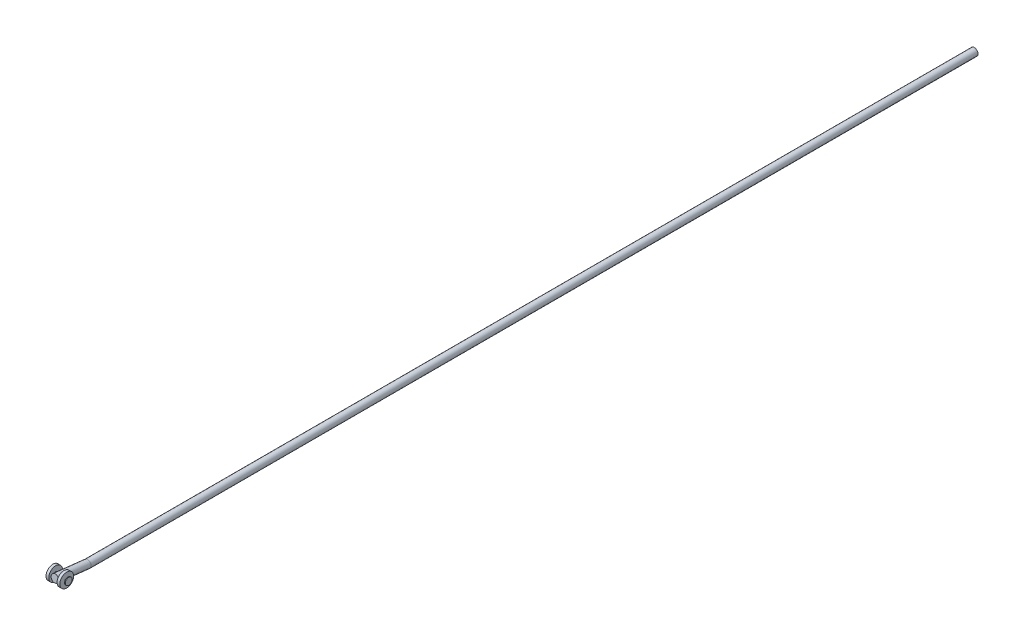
ISO-10303-21;
HEADER;
FILE_DESCRIPTION(('STEP AP214'),'2;1');
FILE_NAME('part.step','',(''),(''),'','','');
FILE_SCHEMA(('AUTOMOTIVE_DESIGN { 1 0 10303 214 1 1 1 1 }'));
ENDSEC;
DATA;
#1=APPLICATION_CONTEXT('core data for automotive mechanical design processes');
#2=APPLICATION_PROTOCOL_DEFINITION('international standard','automotive_design',2000,#1);
#3=PRODUCT_CONTEXT('',#1,'mechanical');
#4=PRODUCT('Part','Part','',(#3));
#5=PRODUCT_RELATED_PRODUCT_CATEGORY('part','',(#4));
#6=PRODUCT_DEFINITION_FORMATION('','',#4);
#7=PRODUCT_DEFINITION_CONTEXT('part definition',#1,'design');
#8=PRODUCT_DEFINITION('design','',#6,#7);
#9=PRODUCT_DEFINITION_SHAPE('','',#8);
#10=(LENGTH_UNIT() NAMED_UNIT(*) SI_UNIT(.MILLI.,.METRE.));
#11=(NAMED_UNIT(*) PLANE_ANGLE_UNIT() SI_UNIT($,.RADIAN.));
#12=(NAMED_UNIT(*) SI_UNIT($,.STERADIAN.) SOLID_ANGLE_UNIT());
#13=UNCERTAINTY_MEASURE_WITH_UNIT(LENGTH_MEASURE(1.E-05),#10,'distance_accuracy_value','');
#14=(GEOMETRIC_REPRESENTATION_CONTEXT(3) GLOBAL_UNCERTAINTY_ASSIGNED_CONTEXT((#13)) GLOBAL_UNIT_ASSIGNED_CONTEXT((#10,
#11,#12)) REPRESENTATION_CONTEXT('',''));
#15=CARTESIAN_POINT('',(0.,0.,0.));
#16=DIRECTION('',(0.,0.,1.));
#17=DIRECTION('',(1.,0.,0.));
#18=AXIS2_PLACEMENT_3D('',#15,#16,#17);
#19=CARTESIAN_POINT('',(9.75,3.4180682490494,992.5));
#20=DIRECTION('',(-1.,0.,0.));
#21=DIRECTION('',(0.,0.,1.));
#22=AXIS2_PLACEMENT_3D('',#19,#20,#21);
#23=CYLINDRICAL_SURFACE('',#22,2.);
#24=CARTESIAN_POINT('',(7.5,3.4180682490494,992.5));
#25=DIRECTION('',(-1.,0.,0.));
#26=DIRECTION('',(0.,0.,1.));
#27=AXIS2_PLACEMENT_3D('',#24,#25,#26);
#28=CIRCLE('',#27,2.);
#29=CARTESIAN_POINT('',(7.5,3.41806824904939,994.5));
#30=VERTEX_POINT('',#29);
#31=EDGE_CURVE('E20',#30,#30,#28,.T.);
#32=ORIENTED_EDGE('',*,*,#31,.F.);
#33=EDGE_LOOP('',(#32));
#34=FACE_BOUND('',#33,.T.);
#35=CARTESIAN_POINT('',(8.95,3.4180682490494,992.5));
#36=DIRECTION('',(1.,0.,0.));
#37=DIRECTION('',(0.,0.,-1.));
#38=AXIS2_PLACEMENT_3D('',#35,#36,#37);
#39=CIRCLE('',#38,2.);
#40=CARTESIAN_POINT('',(8.95,3.4180682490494,990.5));
#41=VERTEX_POINT('',#40);
#42=EDGE_CURVE('E8',#41,#41,#39,.T.);
#43=ORIENTED_EDGE('',*,*,#42,.F.);
#44=EDGE_LOOP('',(#43));
#45=FACE_BOUND('',#44,.T.);
#46=ADVANCED_FACE('F12',(#34,#45),#23,.T.);
#47=CARTESIAN_POINT('',(0.,0.,962.5));
#48=DIRECTION('',(0.,0.113203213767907,0.993571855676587));
#49=DIRECTION('',(0.,-0.993571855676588,0.113203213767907));
#50=AXIS2_PLACEMENT_3D('',#47,#48,#49);
#51=CYLINDRICAL_SURFACE('',#50,4.);
#52=CARTESIAN_POINT('',(-3.99358737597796,3.4180682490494,994.5));
#53=CARTESIAN_POINT('',(-3.99937040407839,3.52083185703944,994.499993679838));
#54=CARTESIAN_POINT('',(-4.00126596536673,3.62391842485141,994.492037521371));
#55=CARTESIAN_POINT('',(-3.99705373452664,3.82755391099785,994.460349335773));
#56=CARTESIAN_POINT('',(-3.99093520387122,3.92809924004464,994.436596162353));
#57=CARTESIAN_POINT('',(-3.97132265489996,4.12343046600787,994.374285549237));
#58=CARTESIAN_POINT('',(-3.95784720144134,4.21823019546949,994.335765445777));
#59=CARTESIAN_POINT('',(-3.92479936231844,4.39999315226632,994.245319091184));
#60=CARTESIAN_POINT('',(-3.90522686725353,4.48695623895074,994.1933925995));
#61=CARTESIAN_POINT('',(-3.860794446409,4.65468987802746,994.075344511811));
#62=CARTESIAN_POINT('',(-3.83575190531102,4.73506492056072,994.008731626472));
#63=CARTESIAN_POINT('',(-3.78309154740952,4.88412669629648,993.864351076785));
#64=CARTESIAN_POINT('',(-3.75547224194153,4.95280660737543,993.786576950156));
#65=CARTESIAN_POINT('',(-3.69731707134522,5.08348571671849,993.613236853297));
#66=CARTESIAN_POINT('',(-3.66676215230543,5.14415845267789,993.5166727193));
#67=CARTESIAN_POINT('',(-3.60884209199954,5.24855643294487,993.313832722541));
#68=CARTESIAN_POINT('',(-3.58147772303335,5.29227757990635,993.207554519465));
#69=CARTESIAN_POINT('',(-3.53343540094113,5.3612486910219,992.987240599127));
#70=CARTESIAN_POINT('',(-3.51277948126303,5.38643812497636,992.873180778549));
#71=CARTESIAN_POINT('',(-3.48162431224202,5.41649811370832,992.641114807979));
#72=CARTESIAN_POINT('',(-3.47110985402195,5.42139913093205,992.523114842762));
#73=CARTESIAN_POINT('',(-3.46268321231,5.41094218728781,992.302097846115));
#74=CARTESIAN_POINT('',(-3.46338626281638,5.39799006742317,992.199014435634));
#75=CARTESIAN_POINT('',(-3.47394233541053,5.35642104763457,991.996545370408));
#76=CARTESIAN_POINT('',(-3.48379609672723,5.32780288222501,991.897160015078));
#77=CARTESIAN_POINT('',(-3.51058114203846,5.25784202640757,991.709567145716));
#78=CARTESIAN_POINT('',(-3.52715111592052,5.21717390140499,991.621052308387));
#79=CARTESIAN_POINT('',(-3.56542142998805,5.12405317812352,991.451685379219));
#80=CARTESIAN_POINT('',(-3.58712341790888,5.07159679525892,991.370835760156));
#81=CARTESIAN_POINT('',(-3.63604919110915,4.95001498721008,991.209897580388));
#82=CARTESIAN_POINT('',(-3.66361477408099,4.87971004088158,991.130804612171));
#83=CARTESIAN_POINT('',(-3.71971318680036,4.72772581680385,990.984771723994));
#84=CARTESIAN_POINT('',(-3.74824663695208,4.64603913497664,990.91783978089));
#85=CARTESIAN_POINT('',(-3.80636968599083,4.46428600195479,990.7915417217));
#86=CARTESIAN_POINT('',(-3.83579137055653,4.36320425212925,990.733547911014));
#87=CARTESIAN_POINT('',(-3.88944229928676,4.15134454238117,990.635621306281));
#88=CARTESIAN_POINT('',(-3.91367316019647,4.04056961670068,990.595682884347));
#89=CARTESIAN_POINT('',(-3.9533537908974,3.81687969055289,990.536896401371));
#90=CARTESIAN_POINT('',(-3.96911584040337,3.70422722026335,990.517269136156));
#91=CARTESIAN_POINT('',(-3.99144832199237,3.47635133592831,990.497588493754));
#92=CARTESIAN_POINT('',(-3.99802618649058,3.36113007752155,990.497519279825));
#93=CARTESIAN_POINT('',(-4.00105151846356,3.143597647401,990.516217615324));
#94=CARTESIAN_POINT('',(-3.99843484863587,3.04113478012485,990.533126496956));
#95=CARTESIAN_POINT('',(-3.98538179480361,2.84053554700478,990.582418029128));
#96=CARTESIAN_POINT('',(-3.97494569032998,2.74239902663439,990.614800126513));
#97=CARTESIAN_POINT('',(-3.94751258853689,2.55473751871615,990.69311619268));
#98=CARTESIAN_POINT('',(-3.93063121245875,2.46509368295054,990.738808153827));
#99=CARTESIAN_POINT('',(-3.89178602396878,2.29444036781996,990.842460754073));
#100=CARTESIAN_POINT('',(-3.86982092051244,2.21343308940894,990.900424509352));
#101=CARTESIAN_POINT('',(-3.82068014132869,2.05528166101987,991.032262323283));
#102=CARTESIAN_POINT('',(-3.79322649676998,1.978982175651,991.10704491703));
#103=CARTESIAN_POINT('',(-3.73695766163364,1.83937451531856,991.267501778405));
#104=CARTESIAN_POINT('',(-3.70814145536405,1.77607622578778,991.353184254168));
#105=CARTESIAN_POINT('',(-3.64943029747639,1.65883711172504,991.541640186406));
#106=CARTESIAN_POINT('',(-3.6196559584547,1.60617054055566,991.645249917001));
#107=CARTESIAN_POINT('',(-3.56540497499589,1.51924585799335,991.861245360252));
#108=CARTESIAN_POINT('',(-3.54092619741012,1.48498032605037,991.973627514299));
#109=CARTESIAN_POINT('',(-3.50169898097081,1.4374997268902,992.199743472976));
#110=CARTESIAN_POINT('',(-3.48660715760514,1.42351314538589,992.313252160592));
#111=CARTESIAN_POINT('',(-3.46722537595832,1.41524850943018,992.541853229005));
#112=CARTESIAN_POINT('',(-3.4629222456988,1.42094640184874,992.656943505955));
#113=CARTESIAN_POINT('',(-3.46566946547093,1.45002321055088,992.869982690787));
#114=CARTESIAN_POINT('',(-3.47136600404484,1.4710995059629,992.968273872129));
#115=CARTESIAN_POINT('',(-3.49076284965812,1.52742346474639,993.159876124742));
#116=CARTESIAN_POINT('',(-3.50446544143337,1.56267517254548,993.253185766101));
#117=CARTESIAN_POINT('',(-3.53814243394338,1.6460190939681,993.432537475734));
#118=CARTESIAN_POINT('',(-3.55811370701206,1.69410490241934,993.518583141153));
#119=CARTESIAN_POINT('',(-3.60218691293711,1.80174486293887,993.681981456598));
#120=CARTESIAN_POINT('',(-3.62629024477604,1.86130289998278,993.759331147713));
#121=CARTESIAN_POINT('',(-3.67953416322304,1.99864251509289,993.913201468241));
#122=CARTESIAN_POINT('',(-3.70892913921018,2.07776661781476,993.988438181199));
#123=CARTESIAN_POINT('',(-3.76720952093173,2.24736352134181,994.125216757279));
#124=CARTESIAN_POINT('',(-3.79609442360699,2.33784688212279,994.186745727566));
#125=CARTESIAN_POINT('',(-3.85236688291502,2.53473146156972,994.298149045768));
#126=CARTESIAN_POINT('',(-3.87952938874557,2.64178941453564,994.346984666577));
#127=CARTESIAN_POINT('',(-3.92698634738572,2.86402905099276,994.425316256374));
#128=CARTESIAN_POINT('',(-3.94729855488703,2.97918878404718,994.454862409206));
#129=CARTESIAN_POINT('',(-3.97005554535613,3.14945629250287,994.482608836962));
#130=CARTESIAN_POINT('',(-3.97618789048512,3.20283030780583,994.489112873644));
#131=CARTESIAN_POINT('',(-3.98643408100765,3.31012918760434,994.497810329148));
#132=CARTESIAN_POINT('',(-3.99054772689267,3.36405410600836,994.500003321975));
#133=CARTESIAN_POINT('',(-3.99358737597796,3.4180682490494,994.5));
#134=B_SPLINE_CURVE_WITH_KNOTS('',3,(#52,#53,#54,#55,#56,#57,#58,#59,#60,#61,#62,#63,#64,#65,
#66,#67,#68,#69,#70,#71,#72,#73,#74,#75,#76,#77,#78,#79,#80,#81,#82,#83,#84,#85,#86,#87,#88,#89,
#90,#91,#92,#93,#94,#95,#96,#97,#98,#99,#100,#101,#102,#103,#104,#105,#106,#107,#108,#109,#110,
#111,#112,#113,#114,#115,#116,#117,#118,#119,#120,#121,#122,#123,#124,#125,#126,#127,#128,#129,
#130,#131,#132,#133),.UNSPECIFIED.,.T.,.F.,(4,2,2,2,2,2,2,2,2,2,2,2,2,2,2,2,2,2,2,2,2,2,2,2,2,2,
2,2,2,2,2,2,2,2,2,2,2,2,2,2,4),(0.,0.308569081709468,0.617552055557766,0.9257589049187,
1.23397128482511,1.55471444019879,1.87564405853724,2.22821798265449,2.58087707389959,
2.93468300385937,3.28795751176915,3.59799922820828,3.90806599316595,4.20329261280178,
4.49861414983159,4.82534672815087,5.1522928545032,5.51109030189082,5.86977583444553,
6.21412414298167,6.55819362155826,6.86830063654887,7.17839656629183,7.48317289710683,
7.78802671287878,8.11757839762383,8.44737973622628,8.80556609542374,9.16360790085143,
9.50763416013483,9.85124019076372,10.1518331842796,10.4525120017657,10.7530410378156,
11.0536720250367,11.3914576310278,11.7295596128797,12.0900019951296,12.4495028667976,
12.6116755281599,12.7738642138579),.UNSPECIFIED.);
#135=CARTESIAN_POINT('',(-3.99358737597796,3.4180682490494,994.5));
#136=VERTEX_POINT('',#135);
#137=EDGE_CURVE('E47',#136,#136,#134,.T.);
#138=ORIENTED_EDGE('',*,*,#137,.F.);
#139=EDGE_LOOP('',(#138));
#140=FACE_BOUND('',#139,.T.);
#141=CARTESIAN_POINT('',(0.,0.,962.5));
#142=DIRECTION('',(0.,0.0566927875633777,0.998391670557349));
#143=DIRECTION('',(0.,0.998391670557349,-0.0566927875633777));
#144=AXIS2_PLACEMENT_3D('',#141,#142,#143);
#145=ELLIPSE('',#144,4.00644368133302,4.);
#146=CARTESIAN_POINT('',(0.,4.,962.27286353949));
#147=VERTEX_POINT('',#146);
#148=EDGE_CURVE('E115',#147,#147,#145,.F.);
#149=ORIENTED_EDGE('',*,*,#148,.F.);
#150=EDGE_LOOP('',(#149));
#151=FACE_BOUND('',#150,.T.);
#152=CARTESIAN_POINT('',(0.,4.03218117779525,997.89));
#153=DIRECTION('',(0.,0.113203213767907,0.993571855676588));
#154=DIRECTION('',(0.,-0.993571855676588,0.113203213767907));
#155=AXIS2_PLACEMENT_3D('',#152,#153,#154);
#156=CIRCLE('',#155,4.);
#157=CARTESIAN_POINT('',(0.,0.0578937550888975,998.342812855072));
#158=VERTEX_POINT('',#157);
#159=EDGE_CURVE('E113',#158,#158,#156,.T.);
#160=ORIENTED_EDGE('',*,*,#159,.F.);
#161=EDGE_LOOP('',(#160));
#162=FACE_BOUND('',#161,.T.);
#163=CARTESIAN_POINT('',(3.99358737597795,3.4180682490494,994.5));
#164=CARTESIAN_POINT('',(3.9874930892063,3.30997215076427,994.49999370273));
#165=CARTESIAN_POINT('',(3.97707821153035,3.20197487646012,994.491184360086));
#166=CARTESIAN_POINT('',(3.94869154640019,2.98963618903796,994.456547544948));
#167=CARTESIAN_POINT('',(3.93070160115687,2.88530421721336,994.430679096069));
#168=CARTESIAN_POINT('',(3.88906878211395,2.68362880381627,994.363289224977));
#169=CARTESIAN_POINT('',(3.86545309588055,2.58625459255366,994.321842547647));
#170=CARTESIAN_POINT('',(3.81469645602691,2.39998180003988,994.224686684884));
#171=CARTESIAN_POINT('',(3.78755593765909,2.31108217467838,994.168979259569));
#172=CARTESIAN_POINT('',(3.73015274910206,2.13728452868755,994.040165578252));
#173=CARTESIAN_POINT('',(3.69980537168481,2.05312215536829,993.966102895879));
#174=CARTESIAN_POINT('',(3.64094720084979,1.89796551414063,993.80454563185));
#175=CARTESIAN_POINT('',(3.6124374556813,1.82697871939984,993.717043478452));
#176=CARTESIAN_POINT('',(3.55981419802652,1.69809426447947,993.527253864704));
#177=CARTESIAN_POINT('',(3.53586896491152,1.64068362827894,993.424585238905));
#178=CARTESIAN_POINT('',(3.49722192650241,1.54438653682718,993.209340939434));
#179=CARTESIAN_POINT('',(3.48250686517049,1.50547353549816,993.096779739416));
#180=CARTESIAN_POINT('',(3.46590658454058,1.45132692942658,992.878372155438));
#181=CARTESIAN_POINT('',(3.46278904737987,1.43396087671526,992.773147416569));
#182=CARTESIAN_POINT('',(3.466432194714,1.41619514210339,992.561456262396));
#183=CARTESIAN_POINT('',(3.47319098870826,1.41579221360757,992.454990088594));
#184=CARTESIAN_POINT('',(3.49465644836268,1.43104833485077,992.25246760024));
#185=CARTESIAN_POINT('',(3.50870991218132,1.4454709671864,992.156241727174));
#186=CARTESIAN_POINT('',(3.54264133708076,1.48774071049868,991.967871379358));
#187=CARTESIAN_POINT('',(3.56252112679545,1.51559203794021,991.875728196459));
#188=CARTESIAN_POINT('',(3.60796995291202,1.58671705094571,991.689489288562));
#189=CARTESIAN_POINT('',(3.63388111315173,1.63111050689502,991.595906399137));
#190=CARTESIAN_POINT('',(3.6875889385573,1.73347599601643,991.417050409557));
#191=CARTESIAN_POINT('',(3.71538677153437,1.79145649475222,991.331782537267));
#192=CARTESIAN_POINT('',(3.77350073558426,1.92726056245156,991.161859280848));
#193=CARTESIAN_POINT('',(3.80374405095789,2.00659035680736,991.07837471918));
#194=CARTESIAN_POINT('',(3.86025903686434,2.17922180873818,990.92566451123));
#195=CARTESIAN_POINT('',(3.88653082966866,2.27252303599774,990.856438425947));
#196=CARTESIAN_POINT('',(3.93189876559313,2.46960031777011,990.735466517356));
#197=CARTESIAN_POINT('',(3.95109048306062,2.57321089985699,990.683488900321));
#198=CARTESIAN_POINT('',(3.98055431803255,2.78894553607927,990.597992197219));
#199=CARTESIAN_POINT('',(3.99083441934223,2.90106187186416,990.564456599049));
#200=CARTESIAN_POINT('',(4.00069753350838,3.11837964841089,990.519787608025));
#201=CARTESIAN_POINT('',(4.00124897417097,3.22314868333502,990.506746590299));
#202=CARTESIAN_POINT('',(3.99406901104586,3.43313775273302,990.497298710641));
#203=CARTESIAN_POINT('',(3.98633880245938,3.53835771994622,990.500889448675));
#204=CARTESIAN_POINT('',(3.9638353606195,3.74210885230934,990.523863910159));
#205=CARTESIAN_POINT('',(3.94934283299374,3.84074192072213,990.542638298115));
#206=CARTESIAN_POINT('',(3.91473719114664,4.03317390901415,990.594329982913));
#207=CARTESIAN_POINT('',(3.89462293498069,4.12697184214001,990.627250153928));
#208=CARTESIAN_POINT('',(3.84894231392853,4.31399603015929,990.708795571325));
#209=CARTESIAN_POINT('',(3.82309969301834,4.40675688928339,990.758330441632));
#210=CARTESIAN_POINT('',(3.76918536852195,4.5829941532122,990.870921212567));
#211=CARTESIAN_POINT('',(3.74111218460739,4.66646430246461,990.933986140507));
#212=CARTESIAN_POINT('',(3.68256139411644,4.83009751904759,991.079002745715));
#213=CARTESIAN_POINT('',(3.65210950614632,4.90918801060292,991.162181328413));
#214=CARTESIAN_POINT('',(3.59502919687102,5.05253348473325,991.341677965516));
#215=CARTESIAN_POINT('',(3.56840096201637,5.11678774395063,991.43799666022));
#216=CARTESIAN_POINT('',(3.52281400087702,5.22774267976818,991.640760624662));
#217=CARTESIAN_POINT('',(3.50378417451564,5.27460578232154,991.747099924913));
#218=CARTESIAN_POINT('',(3.47616820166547,5.34936257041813,991.967470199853));
#219=CARTESIAN_POINT('',(3.4675669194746,5.3772837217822,992.081489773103));
#220=CARTESIAN_POINT('',(3.4626778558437,5.41051584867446,992.298374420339));
#221=CARTESIAN_POINT('',(3.46498303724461,5.4182202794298,992.400848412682));
#222=CARTESIAN_POINT('',(3.47839582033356,5.41791165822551,992.605191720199));
#223=CARTESIAN_POINT('',(3.48950487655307,5.40989600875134,992.707060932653));
#224=CARTESIAN_POINT('',(3.51849768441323,5.37930225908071,992.903932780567));
#225=CARTESIAN_POINT('',(3.53614055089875,5.35722393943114,992.999051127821));
#226=CARTESIAN_POINT('',(3.57625173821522,5.29991232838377,993.184148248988));
#227=CARTESIAN_POINT('',(3.59872170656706,5.26467454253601,993.274125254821));
#228=CARTESIAN_POINT('',(3.64907495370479,5.17731075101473,993.457340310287));
#229=CARTESIAN_POINT('',(3.67728312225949,5.12372348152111,993.549792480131));
#230=CARTESIAN_POINT('',(3.73422806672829,5.00263259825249,993.724950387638));
#231=CARTESIAN_POINT('',(3.76296514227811,4.93512086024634,993.807650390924));
#232=CARTESIAN_POINT('',(3.82075045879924,4.78081390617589,993.968470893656));
#233=CARTESIAN_POINT('',(3.8496020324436,4.69284221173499,994.045541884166));
#234=CARTESIAN_POINT('',(3.90160341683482,4.50364034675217,994.183818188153));
#235=CARTESIAN_POINT('',(3.92475344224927,4.40241067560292,994.245024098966));
#236=CARTESIAN_POINT('',(3.96169304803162,4.1947429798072,994.346473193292));
#237=CARTESIAN_POINT('',(3.97589092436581,4.08881442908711,994.387607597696));
#238=CARTESIAN_POINT('',(3.99500612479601,3.87088974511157,994.451350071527));
#239=CARTESIAN_POINT('',(3.99994832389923,3.75891070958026,994.474007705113));
#240=CARTESIAN_POINT('',(4.00001693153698,3.60814677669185,994.491314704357));
#241=CARTESIAN_POINT('',(3.99948422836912,3.57018324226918,994.494570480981));
#242=CARTESIAN_POINT('',(3.99734178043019,3.49416513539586,994.498914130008));
#243=CARTESIAN_POINT('',(3.99573214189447,3.45611057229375,994.500002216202));
#244=CARTESIAN_POINT('',(3.99358737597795,3.4180682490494,994.5));
#245=B_SPLINE_CURVE_WITH_KNOTS('',3,(#163,#164,#165,#166,#167,#168,#169,#170,#171,#172,#173,
#174,#175,#176,#177,#178,#179,#180,#181,#182,#183,#184,#185,#186,#187,#188,#189,#190,#191,#192,
#193,#194,#195,#196,#197,#198,#199,#200,#201,#202,#203,#204,#205,#206,#207,#208,#209,#210,#211,
#212,#213,#214,#215,#216,#217,#218,#219,#220,#221,#222,#223,#224,#225,#226,#227,#228,#229,#230,
#231,#232,#233,#234,#235,#236,#237,#238,#239,#240,#241,#242,#243,#244),.UNSPECIFIED.,.T.,.F.,(4,
2,2,2,2,2,2,2,2,2,2,2,2,2,2,2,2,2,2,2,2,2,2,2,2,2,2,2,2,2,2,2,2,2,2,2,2,2,2,2,4),(0.,
0.324645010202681,0.650072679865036,0.97395846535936,1.29780429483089,1.64470914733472,
1.99181016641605,2.34992937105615,2.70753307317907,3.02583438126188,3.34407476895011,
3.63777018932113,3.93155788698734,4.2505957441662,4.56983291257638,4.92534924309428,
5.28085462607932,5.63136832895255,5.9815676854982,6.29668549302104,6.61175782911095,
6.91477864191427,7.21786105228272,7.54138871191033,7.86513290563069,8.21971858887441,
8.57432155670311,8.92552395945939,9.27621602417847,9.58299411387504,9.88982289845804,
10.1863131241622,10.4829047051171,10.8131058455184,11.1435001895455,11.5030741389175,
11.8626345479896,12.2043113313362,12.5450685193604,12.6593322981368,12.7735848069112),.UNSPECIFIED.);
#246=CARTESIAN_POINT('',(3.99358737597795,3.4180682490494,994.5));
#247=VERTEX_POINT('',#246);
#248=EDGE_CURVE('E28',#247,#247,#245,.T.);
#249=ORIENTED_EDGE('',*,*,#248,.F.);
#250=EDGE_LOOP('',(#249));
#251=FACE_BOUND('',#250,.T.);
#252=ADVANCED_FACE('F14',(#140,#151,#162,#251),#51,.T.);
#253=CARTESIAN_POINT('',(0.,0.,0.));
#254=DIRECTION('',(0.,0.,-1.));
#255=DIRECTION('',(-1.,0.,0.));
#256=AXIS2_PLACEMENT_3D('',#253,#254,#255);
#257=PLANE('',#256);
#258=CARTESIAN_POINT('',(0.,0.,0.));
#259=DIRECTION('',(0.,0.,-1.));
#260=DIRECTION('',(-1.,0.,0.));
#261=AXIS2_PLACEMENT_3D('',#258,#259,#260);
#262=CIRCLE('',#261,4.);
#263=CARTESIAN_POINT('',(-4.,0.,0.));
#264=VERTEX_POINT('',#263);
#265=EDGE_CURVE('E118',#264,#264,#262,.T.);
#266=ORIENTED_EDGE('',*,*,#265,.T.);
#267=EDGE_LOOP('',(#266));
#268=FACE_BOUND('',#267,.T.);
#269=ADVANCED_FACE('F68',(#268),#257,.T.);
#270=CARTESIAN_POINT('',(0.,0.,973.813708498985));
#271=DIRECTION('',(0.,0.,-1.));
#272=DIRECTION('',(0.,1.,0.));
#273=AXIS2_PLACEMENT_3D('',#270,#271,#272);
#274=CYLINDRICAL_SURFACE('',#273,4.);
#275=ORIENTED_EDGE('',*,*,#265,.F.);
#276=EDGE_LOOP('',(#275));
#277=FACE_BOUND('',#276,.T.);
#278=ORIENTED_EDGE('',*,*,#148,.T.);
#279=EDGE_LOOP('',(#278));
#280=FACE_BOUND('',#279,.T.);
#281=ADVANCED_FACE('F66',(#277,#280),#274,.T.);
#282=CARTESIAN_POINT('',(0.,4.03218117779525,997.89));
#283=DIRECTION('',(0.,0.113203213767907,0.993571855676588));
#284=DIRECTION('',(0.,-0.993571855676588,0.113203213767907));
#285=AXIS2_PLACEMENT_3D('',#282,#283,#284);
#286=PLANE('',#285);
#287=ORIENTED_EDGE('',*,*,#159,.T.);
#288=EDGE_LOOP('',(#287));
#289=FACE_BOUND('',#288,.T.);
#290=ADVANCED_FACE('F62',(#289),#286,.T.);
#291=CARTESIAN_POINT('',(-4.5,3.4180682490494,992.5));
#292=DIRECTION('',(1.,0.,0.));
#293=DIRECTION('',(0.,0.,-1.));
#294=AXIS2_PLACEMENT_3D('',#291,#292,#293);
#295=CIRCLE('',#294,2.);
#296=CARTESIAN_POINT('',(-4.5,3.4180682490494,990.5));
#297=VERTEX_POINT('',#296);
#298=EDGE_CURVE('E36',#297,#297,#295,.T.);
#299=ORIENTED_EDGE('',*,*,#298,.T.);
#300=EDGE_LOOP('',(#299));
#301=FACE_BOUND('',#300,.T.);
#302=ORIENTED_EDGE('',*,*,#137,.T.);
#303=EDGE_LOOP('',(#302));
#304=FACE_BOUND('',#303,.T.);
#305=ADVANCED_FACE('F58',(#301,#304),#23,.T.);
#306=CARTESIAN_POINT('',(4.5,3.4180682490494,992.5));
#307=DIRECTION('',(-1.,0.,0.));
#308=DIRECTION('',(0.,0.,1.));
#309=AXIS2_PLACEMENT_3D('',#306,#307,#308);
#310=CIRCLE('',#309,2.);
#311=CARTESIAN_POINT('',(4.5,3.41806824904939,994.5));
#312=VERTEX_POINT('',#311);
#313=EDGE_CURVE('E31',#312,#312,#310,.T.);
#314=ORIENTED_EDGE('',*,*,#313,.T.);
#315=EDGE_LOOP('',(#314));
#316=FACE_BOUND('',#315,.T.);
#317=ORIENTED_EDGE('',*,*,#248,.T.);
#318=EDGE_LOOP('',(#317));
#319=FACE_BOUND('',#318,.T.);
#320=ADVANCED_FACE('F52',(#316,#319),#23,.T.);
#321=CARTESIAN_POINT('',(-7.5,3.4180682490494,992.5));
#322=DIRECTION('',(1.,0.,0.));
#323=DIRECTION('',(0.,0.,-1.));
#324=AXIS2_PLACEMENT_3D('',#321,#322,#323);
#325=PLANE('',#324);
#326=CARTESIAN_POINT('',(-7.5,3.4180682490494,992.5));
#327=DIRECTION('',(1.,0.,0.));
#328=DIRECTION('',(0.,0.,-1.));
#329=AXIS2_PLACEMENT_3D('',#326,#327,#328);
#330=CIRCLE('',#329,7.5);
#331=CARTESIAN_POINT('',(-7.5,3.4180682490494,985.));
#332=VERTEX_POINT('',#331);
#333=EDGE_CURVE('E40',#332,#332,#330,.T.);
#334=ORIENTED_EDGE('',*,*,#333,.F.);
#335=EDGE_LOOP('',(#334));
#336=FACE_BOUND('',#335,.T.);
#337=CARTESIAN_POINT('',(-7.5,3.4180682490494,992.5));
#338=DIRECTION('',(1.,0.,0.));
#339=DIRECTION('',(0.,0.,-1.));
#340=AXIS2_PLACEMENT_3D('',#337,#338,#339);
#341=CIRCLE('',#340,2.);
#342=CARTESIAN_POINT('',(-7.5,3.4180682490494,990.5));
#343=VERTEX_POINT('',#342);
#344=EDGE_CURVE('E24',#343,#343,#341,.T.);
#345=ORIENTED_EDGE('',*,*,#344,.T.);
#346=EDGE_LOOP('',(#345));
#347=FACE_BOUND('',#346,.T.);
#348=ADVANCED_FACE('F57',(#336,#347),#325,.F.);
#349=CARTESIAN_POINT('',(-4.5,3.4180682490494,992.5));
#350=DIRECTION('',(1.,0.,0.));
#351=DIRECTION('',(0.,0.,-1.));
#352=AXIS2_PLACEMENT_3D('',#349,#350,#351);
#353=PLANE('',#352);
#354=CARTESIAN_POINT('',(-4.5,3.4180682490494,992.5));
#355=DIRECTION('',(1.,0.,0.));
#356=DIRECTION('',(0.,0.,-1.));
#357=AXIS2_PLACEMENT_3D('',#354,#355,#356);
#358=CIRCLE('',#357,7.5);
#359=CARTESIAN_POINT('',(-4.5,3.4180682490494,985.));
#360=VERTEX_POINT('',#359);
#361=EDGE_CURVE('E33',#360,#360,#358,.T.);
#362=ORIENTED_EDGE('',*,*,#361,.T.);
#363=EDGE_LOOP('',(#362));
#364=FACE_BOUND('',#363,.T.);
#365=ORIENTED_EDGE('',*,*,#298,.F.);
#366=EDGE_LOOP('',(#365));
#367=FACE_BOUND('',#366,.T.);
#368=ADVANCED_FACE('F161',(#364,#367),#353,.T.);
#369=CARTESIAN_POINT('',(-7.5,3.4180682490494,992.5));
#370=DIRECTION('',(1.,0.,0.));
#371=DIRECTION('',(0.,0.,-1.));
#372=AXIS2_PLACEMENT_3D('',#369,#370,#371);
#373=CYLINDRICAL_SURFACE('',#372,7.5);
#374=ORIENTED_EDGE('',*,*,#333,.T.);
#375=EDGE_LOOP('',(#374));
#376=FACE_BOUND('',#375,.T.);
#377=ORIENTED_EDGE('',*,*,#361,.F.);
#378=EDGE_LOOP('',(#377));
#379=FACE_BOUND('',#378,.T.);
#380=ADVANCED_FACE('F100',(#376,#379),#373,.T.);
#381=CARTESIAN_POINT('',(-9.75,3.4180682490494,992.5));
#382=DIRECTION('',(1.,0.,0.));
#383=DIRECTION('',(0.,0.,-1.));
#384=AXIS2_PLACEMENT_3D('',#381,#382,#383);
#385=PLANE('',#384);
#386=CARTESIAN_POINT('',(-9.75,3.4180682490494,992.5));
#387=DIRECTION('',(1.,0.,0.));
#388=DIRECTION('',(0.,0.,-1.));
#389=AXIS2_PLACEMENT_3D('',#386,#387,#388);
#390=CIRCLE('',#389,2.);
#391=CARTESIAN_POINT('',(-9.75,3.4180682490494,990.5));
#392=VERTEX_POINT('',#391);
#393=EDGE_CURVE('E39',#392,#392,#390,.T.);
#394=ORIENTED_EDGE('',*,*,#393,.F.);
#395=EDGE_LOOP('',(#394));
#396=FACE_BOUND('',#395,.T.);
#397=ADVANCED_FACE('F90',(#396),#385,.F.);
#398=ORIENTED_EDGE('',*,*,#393,.T.);
#399=EDGE_LOOP('',(#398));
#400=FACE_BOUND('',#399,.T.);
#401=ORIENTED_EDGE('',*,*,#344,.F.);
#402=EDGE_LOOP('',(#401));
#403=FACE_BOUND('',#402,.T.);
#404=ADVANCED_FACE('F81',(#400,#403),#23,.T.);
#405=CARTESIAN_POINT('',(7.5,3.4180682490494,992.5));
#406=DIRECTION('',(-1.,0.,0.));
#407=DIRECTION('',(0.,0.,-1.));
#408=AXIS2_PLACEMENT_3D('',#405,#406,#407);
#409=PLANE('',#408);
#410=CARTESIAN_POINT('',(7.5,3.4180682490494,992.5));
#411=DIRECTION('',(1.,0.,0.));
#412=DIRECTION('',(0.,0.,-1.));
#413=AXIS2_PLACEMENT_3D('',#410,#411,#412);
#414=CIRCLE('',#413,7.5);
#415=CARTESIAN_POINT('',(7.5,3.4180682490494,985.));
#416=VERTEX_POINT('',#415);
#417=EDGE_CURVE('E34',#416,#416,#414,.T.);
#418=ORIENTED_EDGE('',*,*,#417,.T.);
#419=EDGE_LOOP('',(#418));
#420=FACE_BOUND('',#419,.T.);
#421=ORIENTED_EDGE('',*,*,#31,.T.);
#422=EDGE_LOOP('',(#421));
#423=FACE_BOUND('',#422,.T.);
#424=ADVANCED_FACE('F89',(#420,#423),#409,.F.);
#425=CARTESIAN_POINT('',(4.5,3.4180682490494,992.5));
#426=DIRECTION('',(-1.,0.,0.));
#427=DIRECTION('',(0.,0.,-1.));
#428=AXIS2_PLACEMENT_3D('',#425,#426,#427);
#429=PLANE('',#428);
#430=CARTESIAN_POINT('',(4.5,3.4180682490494,992.5));
#431=DIRECTION('',(1.,0.,0.));
#432=DIRECTION('',(0.,0.,-1.));
#433=AXIS2_PLACEMENT_3D('',#430,#431,#432);
#434=CIRCLE('',#433,7.5);
#435=CARTESIAN_POINT('',(4.5,3.4180682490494,985.));
#436=VERTEX_POINT('',#435);
#437=EDGE_CURVE('E130',#436,#436,#434,.T.);
#438=ORIENTED_EDGE('',*,*,#437,.F.);
#439=EDGE_LOOP('',(#438));
#440=FACE_BOUND('',#439,.T.);
#441=ORIENTED_EDGE('',*,*,#313,.F.);
#442=EDGE_LOOP('',(#441));
#443=FACE_BOUND('',#442,.T.);
#444=ADVANCED_FACE('F97',(#440,#443),#429,.T.);
#445=CARTESIAN_POINT('',(7.5,3.4180682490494,992.5));
#446=DIRECTION('',(-1.,0.,0.));
#447=DIRECTION('',(0.,0.,1.));
#448=AXIS2_PLACEMENT_3D('',#445,#446,#447);
#449=CYLINDRICAL_SURFACE('',#448,7.5);
#450=ORIENTED_EDGE('',*,*,#417,.F.);
#451=EDGE_LOOP('',(#450));
#452=FACE_BOUND('',#451,.T.);
#453=ORIENTED_EDGE('',*,*,#437,.T.);
#454=EDGE_LOOP('',(#453));
#455=FACE_BOUND('',#454,.T.);
#456=ADVANCED_FACE('F151',(#452,#455),#449,.T.);
#457=CARTESIAN_POINT('',(8.95,3.4180682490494,992.5));
#458=DIRECTION('',(1.,0.,0.));
#459=DIRECTION('',(0.,0.,-1.));
#460=AXIS2_PLACEMENT_3D('',#457,#458,#459);
#461=PLANE('',#460);
#462=CARTESIAN_POINT('',(8.95,3.4180682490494,992.5));
#463=DIRECTION('',(1.,0.,0.));
#464=DIRECTION('',(0.,0.,-1.));
#465=AXIS2_PLACEMENT_3D('',#462,#463,#464);
#466=CIRCLE('',#465,3.75);
#467=CARTESIAN_POINT('',(8.95,3.4180682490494,988.75));
#468=VERTEX_POINT('',#467);
#469=EDGE_CURVE('E133',#468,#468,#466,.T.);
#470=ORIENTED_EDGE('',*,*,#469,.F.);
#471=EDGE_LOOP('',(#470));
#472=FACE_BOUND('',#471,.T.);
#473=ORIENTED_EDGE('',*,*,#42,.T.);
#474=EDGE_LOOP('',(#473));
#475=FACE_BOUND('',#474,.T.);
#476=ADVANCED_FACE('F143',(#472,#475),#461,.F.);
#477=CARTESIAN_POINT('',(8.95,3.4180682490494,992.5));
#478=DIRECTION('',(1.,0.,0.));
#479=DIRECTION('',(0.,0.,-1.));
#480=AXIS2_PLACEMENT_3D('',#477,#478,#479);
#481=CYLINDRICAL_SURFACE('',#480,3.75);
#482=ORIENTED_EDGE('',*,*,#469,.T.);
#483=EDGE_LOOP('',(#482));
#484=FACE_BOUND('',#483,.T.);
#485=CARTESIAN_POINT('',(9.75,3.4180682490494,992.5));
#486=DIRECTION('',(1.,0.,0.));
#487=DIRECTION('',(0.,0.,-1.));
#488=AXIS2_PLACEMENT_3D('',#485,#486,#487);
#489=CIRCLE('',#488,3.75);
#490=CARTESIAN_POINT('',(9.75,3.4180682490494,988.75));
#491=VERTEX_POINT('',#490);
#492=EDGE_CURVE('E136',#491,#491,#489,.T.);
#493=ORIENTED_EDGE('',*,*,#492,.F.);
#494=EDGE_LOOP('',(#493));
#495=FACE_BOUND('',#494,.T.);
#496=ADVANCED_FACE('F141',(#484,#495),#481,.T.);
#497=CARTESIAN_POINT('',(9.75,3.4180682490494,992.5));
#498=DIRECTION('',(1.,0.,0.));
#499=DIRECTION('',(0.,0.,-1.));
#500=AXIS2_PLACEMENT_3D('',#497,#498,#499);
#501=PLANE('',#500);
#502=ORIENTED_EDGE('',*,*,#492,.T.);
#503=EDGE_LOOP('',(#502));
#504=FACE_BOUND('',#503,.T.);
#505=ADVANCED_FACE('F60',(#504),#501,.T.);
#506=CLOSED_SHELL('',(#46,#252,#269,#281,#290,#305,#320,#348,#368,#380,#397,#404,#424,#444,#456,
#476,#496,#505));
#507=MANIFOLD_SOLID_BREP('B1',#506);
#508=ADVANCED_BREP_SHAPE_REPRESENTATION('',(#18,#507),#14);
#509=SHAPE_DEFINITION_REPRESENTATION(#9,#508);
ENDSEC;
END-ISO-10303-21;
